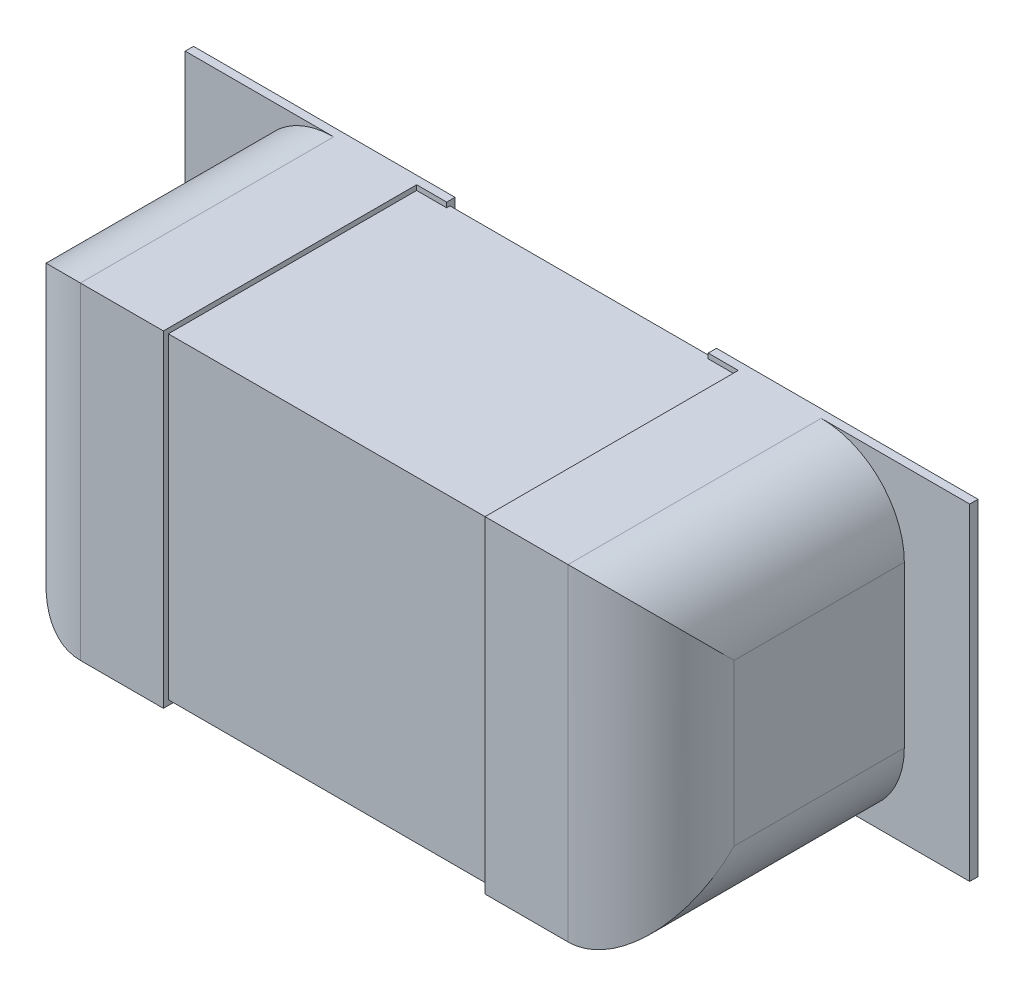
ISO-10303-21;
HEADER;
FILE_DESCRIPTION(('STEP AP214'),'2;1');
FILE_NAME('part.step','',(''),(''),'','','');
FILE_SCHEMA(('AUTOMOTIVE_DESIGN { 1 0 10303 214 1 1 1 1 }'));
ENDSEC;
DATA;
#1=APPLICATION_CONTEXT('core data for automotive mechanical design processes');
#2=APPLICATION_PROTOCOL_DEFINITION('international standard','automotive_design',2000,#1);
#3=PRODUCT_CONTEXT('',#1,'mechanical');
#4=PRODUCT('Part','Part','',(#3));
#5=PRODUCT_RELATED_PRODUCT_CATEGORY('part','',(#4));
#6=PRODUCT_DEFINITION_FORMATION('','',#4);
#7=PRODUCT_DEFINITION_CONTEXT('part definition',#1,'design');
#8=PRODUCT_DEFINITION('design','',#6,#7);
#9=PRODUCT_DEFINITION_SHAPE('','',#8);
#10=(LENGTH_UNIT() NAMED_UNIT(*) SI_UNIT(.MILLI.,.METRE.));
#11=(NAMED_UNIT(*) PLANE_ANGLE_UNIT() SI_UNIT($,.RADIAN.));
#12=(NAMED_UNIT(*) SI_UNIT($,.STERADIAN.) SOLID_ANGLE_UNIT());
#13=UNCERTAINTY_MEASURE_WITH_UNIT(LENGTH_MEASURE(1.E-05),#10,'distance_accuracy_value','');
#14=(GEOMETRIC_REPRESENTATION_CONTEXT(3) GLOBAL_UNCERTAINTY_ASSIGNED_CONTEXT((#13)) GLOBAL_UNIT_ASSIGNED_CONTEXT((#10,
#11,#12)) REPRESENTATION_CONTEXT('',''));
#15=CARTESIAN_POINT('',(0.,0.,0.));
#16=DIRECTION('',(0.,0.,1.));
#17=DIRECTION('',(1.,0.,0.));
#18=AXIS2_PLACEMENT_3D('',#15,#16,#17);
#19=CARTESIAN_POINT('',(0.500000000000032,-0.249999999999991,0.0762));
#20=DIRECTION('',(1.,0.,0.));
#21=DIRECTION('',(0.,0.,-1.));
#22=AXIS2_PLACEMENT_3D('',#19,#20,#21);
#23=PLANE('',#22);
#24=DIRECTION('',(0.,0.,-1.));
#25=VECTOR('',#24,1.);
#26=CARTESIAN_POINT('',(0.500000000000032,-0.122999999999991,0.478378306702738));
#27=LINE('',#26,#25);
#28=CARTESIAN_POINT('',(0.500000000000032,-0.122999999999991,0.0889));
#29=VERTEX_POINT('',#28);
#30=CARTESIAN_POINT('',(0.500000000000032,-0.122999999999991,0.34925));
#31=VERTEX_POINT('',#30);
#32=EDGE_CURVE('E336',#29,#31,#27,.F.);
#33=ORIENTED_EDGE('',*,*,#32,.F.);
#34=DIRECTION('',(0.,1.,0.));
#35=VECTOR('',#34,1.);
#36=CARTESIAN_POINT('',(0.500000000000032,0.,0.0889));
#37=LINE('',#36,#35);
#38=CARTESIAN_POINT('',(0.500000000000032,0.122999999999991,0.0889));
#39=VERTEX_POINT('',#38);
#40=EDGE_CURVE('E202',#39,#29,#37,.F.);
#41=ORIENTED_EDGE('',*,*,#40,.F.);
#42=DIRECTION('',(0.,0.,-1.));
#43=VECTOR('',#42,1.);
#44=CARTESIAN_POINT('',(0.500000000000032,0.122999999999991,0.478378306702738));
#45=LINE('',#44,#43);
#46=CARTESIAN_POINT('',(0.500000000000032,0.122999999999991,0.34925));
#47=VERTEX_POINT('',#46);
#48=EDGE_CURVE('E197',#47,#39,#45,.T.);
#49=ORIENTED_EDGE('',*,*,#48,.F.);
#50=DIRECTION('',(0.,1.,0.));
#51=VECTOR('',#50,1.);
#52=CARTESIAN_POINT('',(0.500000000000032,-0.252051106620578,0.34925));
#53=LINE('',#52,#51);
#54=EDGE_CURVE('E200',#31,#47,#53,.T.);
#55=ORIENTED_EDGE('',*,*,#54,.F.);
#56=EDGE_LOOP('',(#33,#41,#49,#55));
#57=FACE_BOUND('',#56,.T.);
#58=ADVANCED_FACE('F16',(#57),#23,.T.);
#59=CARTESIAN_POINT('',(-0.500000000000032,0.249999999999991,0.0762));
#60=DIRECTION('',(-1.,0.,0.));
#61=DIRECTION('',(0.,0.,1.));
#62=AXIS2_PLACEMENT_3D('',#59,#60,#61);
#63=PLANE('',#62);
#64=DIRECTION('',(0.,0.,-1.));
#65=VECTOR('',#64,1.);
#66=CARTESIAN_POINT('',(-0.500000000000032,0.122999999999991,0.478378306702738));
#67=LINE('',#66,#65);
#68=CARTESIAN_POINT('',(-0.500000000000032,0.122999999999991,0.0889));
#69=VERTEX_POINT('',#68);
#70=CARTESIAN_POINT('',(-0.500000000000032,0.122999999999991,0.34925));
#71=VERTEX_POINT('',#70);
#72=EDGE_CURVE('E321',#69,#71,#67,.F.);
#73=ORIENTED_EDGE('',*,*,#72,.F.);
#74=DIRECTION('',(0.,1.,0.));
#75=VECTOR('',#74,1.);
#76=CARTESIAN_POINT('',(-0.500000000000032,0.,0.0889));
#77=LINE('',#76,#75);
#78=CARTESIAN_POINT('',(-0.500000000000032,-0.122999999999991,0.0889));
#79=VERTEX_POINT('',#78);
#80=EDGE_CURVE('E325',#79,#69,#77,.T.);
#81=ORIENTED_EDGE('',*,*,#80,.F.);
#82=DIRECTION('',(0.,0.,-1.));
#83=VECTOR('',#82,1.);
#84=CARTESIAN_POINT('',(-0.500000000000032,-0.122999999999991,0.478378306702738));
#85=LINE('',#84,#83);
#86=CARTESIAN_POINT('',(-0.500000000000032,-0.122999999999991,0.34925));
#87=VERTEX_POINT('',#86);
#88=EDGE_CURVE('E350',#87,#79,#85,.T.);
#89=ORIENTED_EDGE('',*,*,#88,.F.);
#90=DIRECTION('',(0.,-1.,0.));
#91=VECTOR('',#90,1.);
#92=CARTESIAN_POINT('',(-0.500000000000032,0.252091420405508,0.34925));
#93=LINE('',#92,#91);
#94=EDGE_CURVE('E330',#71,#87,#93,.T.);
#95=ORIENTED_EDGE('',*,*,#94,.F.);
#96=EDGE_LOOP('',(#73,#81,#89,#95));
#97=FACE_BOUND('',#96,.T.);
#98=ADVANCED_FACE('F614',(#97),#63,.T.);
#99=CARTESIAN_POINT('',(0.373000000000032,0.122999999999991,0.478378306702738));
#100=DIRECTION('',(0.,0.,-1.));
#101=DIRECTION('',(-1.,0.,0.));
#102=AXIS2_PLACEMENT_3D('',#99,#100,#101);
#103=CYLINDRICAL_SURFACE('',#102,0.127);
#104=ORIENTED_EDGE('',*,*,#48,.T.);
#105=CARTESIAN_POINT('',(0.373000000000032,0.122999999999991,0.0889));
#106=DIRECTION('',(0.,0.,-1.));
#107=DIRECTION('',(-1.,0.,0.));
#108=AXIS2_PLACEMENT_3D('',#105,#106,#107);
#109=CIRCLE('',#108,0.127);
#110=CARTESIAN_POINT('',(0.372864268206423,0.249999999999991,0.0889000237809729));
#111=VERTEX_POINT('',#110);
#112=EDGE_CURVE('E219',#111,#39,#109,.T.);
#113=ORIENTED_EDGE('',*,*,#112,.F.);
#114=DIRECTION('',(-0.00035041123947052,0.,-0.99999993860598));
#115=VECTOR('',#114,1.);
#116=CARTESIAN_POINT('',(0.373000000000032,0.249999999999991,0.47625));
#117=LINE('',#116,#115);
#118=CARTESIAN_POINT('',(0.373000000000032,0.249999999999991,0.47625));
#119=VERTEX_POINT('',#118);
#120=EDGE_CURVE('E217',#119,#111,#117,.T.);
#121=ORIENTED_EDGE('',*,*,#120,.F.);
#122=CARTESIAN_POINT('',(0.373000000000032,0.122999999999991,0.34925));
#123=DIRECTION('',(0.,0.707106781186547,-0.707106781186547));
#124=DIRECTION('',(0.,0.707106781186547,0.707106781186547));
#125=AXIS2_PLACEMENT_3D('',#122,#123,#124);
#126=ELLIPSE('',#125,0.179605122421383,0.127);
#127=EDGE_CURVE('E19',#47,#119,#126,.F.);
#128=ORIENTED_EDGE('',*,*,#127,.F.);
#129=EDGE_LOOP('',(#104,#113,#121,#128));
#130=FACE_BOUND('',#129,.T.);
#131=ADVANCED_FACE('F216',(#130),#103,.T.);
#132=CARTESIAN_POINT('',(0.373000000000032,-0.252051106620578,0.34925));
#133=DIRECTION('',(0.,1.,0.));
#134=DIRECTION('',(0.,0.,1.));
#135=AXIS2_PLACEMENT_3D('',#132,#133,#134);
#136=CYLINDRICAL_SURFACE('',#135,0.127);
#137=CARTESIAN_POINT('',(0.373000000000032,-0.122999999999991,0.34925));
#138=DIRECTION('',(0.,-0.707106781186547,-0.707106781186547));
#139=DIRECTION('',(0.,0.707106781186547,-0.707106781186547));
#140=AXIS2_PLACEMENT_3D('',#137,#138,#139);
#141=ELLIPSE('',#140,0.179605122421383,0.127);
#142=CARTESIAN_POINT('',(0.373000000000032,-0.249999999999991,0.47625));
#143=VERTEX_POINT('',#142);
#144=EDGE_CURVE('E213',#31,#143,#141,.T.);
#145=ORIENTED_EDGE('',*,*,#144,.F.);
#146=ORIENTED_EDGE('',*,*,#54,.T.);
#147=ORIENTED_EDGE('',*,*,#127,.T.);
#148=DIRECTION('',(0.,1.,0.));
#149=VECTOR('',#148,1.);
#150=CARTESIAN_POINT('',(0.373000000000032,0.,0.47625));
#151=LINE('',#150,#149);
#152=EDGE_CURVE('E229',#143,#119,#151,.T.);
#153=ORIENTED_EDGE('',*,*,#152,.F.);
#154=EDGE_LOOP('',(#145,#146,#147,#153));
#155=FACE_BOUND('',#154,.T.);
#156=ADVANCED_FACE('F210',(#155),#136,.T.);
#157=CARTESIAN_POINT('',(0.5999988,-0.2500122,0.0762));
#158=DIRECTION('',(1.,0.,0.));
#159=DIRECTION('',(0.,0.,-1.));
#160=AXIS2_PLACEMENT_3D('',#157,#158,#159);
#161=PLANE('',#160);
#162=DIRECTION('',(0.,0.,-1.));
#163=VECTOR('',#162,1.);
#164=CARTESIAN_POINT('',(0.5999988,-0.249999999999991,0.0762));
#165=LINE('',#164,#163);
#166=CARTESIAN_POINT('',(0.5999988,-0.249999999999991,0.0762));
#167=VERTEX_POINT('',#166);
#168=CARTESIAN_POINT('',(0.5999988,-0.249999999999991,0.0889));
#169=VERTEX_POINT('',#168);
#170=EDGE_CURVE('E235',#167,#169,#165,.F.);
#171=ORIENTED_EDGE('',*,*,#170,.F.);
#172=DIRECTION('',(0.,1.,0.));
#173=VECTOR('',#172,1.);
#174=CARTESIAN_POINT('',(0.5999988,0.,0.0762));
#175=LINE('',#174,#173);
#176=CARTESIAN_POINT('',(0.5999988,0.249999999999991,0.0762));
#177=VERTEX_POINT('',#176);
#178=EDGE_CURVE('E334',#167,#177,#175,.T.);
#179=ORIENTED_EDGE('',*,*,#178,.T.);
#180=DIRECTION('',(0.,0.,1.));
#181=VECTOR('',#180,1.);
#182=CARTESIAN_POINT('',(0.5999988,0.249999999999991,0.0762));
#183=LINE('',#182,#181);
#184=CARTESIAN_POINT('',(0.5999988,0.249999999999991,0.0889));
#185=VERTEX_POINT('',#184);
#186=EDGE_CURVE('E313',#185,#177,#183,.F.);
#187=ORIENTED_EDGE('',*,*,#186,.F.);
#188=DIRECTION('',(0.,1.,0.));
#189=VECTOR('',#188,1.);
#190=CARTESIAN_POINT('',(0.5999988,0.,0.0889));
#191=LINE('',#190,#189);
#192=EDGE_CURVE('E214',#169,#185,#191,.T.);
#193=ORIENTED_EDGE('',*,*,#192,.F.);
#194=EDGE_LOOP('',(#171,#179,#187,#193));
#195=FACE_BOUND('',#194,.T.);
#196=ADVANCED_FACE('F346',(#195),#161,.T.);
#197=CARTESIAN_POINT('',(0.,0.,0.0889));
#198=DIRECTION('',(0.,0.,1.));
#199=DIRECTION('',(1.,0.,0.));
#200=AXIS2_PLACEMENT_3D('',#197,#198,#199);
#201=PLANE('',#200);
#202=ORIENTED_EDGE('',*,*,#112,.T.);
#203=ORIENTED_EDGE('',*,*,#40,.T.);
#204=CARTESIAN_POINT('',(0.373000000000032,-0.122999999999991,0.0889));
#205=DIRECTION('',(0.,0.,-1.));
#206=DIRECTION('',(-1.,0.,0.));
#207=AXIS2_PLACEMENT_3D('',#204,#205,#206);
#208=CIRCLE('',#207,0.127);
#209=CARTESIAN_POINT('',(0.372864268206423,-0.249999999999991,0.088900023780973));
#210=VERTEX_POINT('',#209);
#211=EDGE_CURVE('E331',#210,#29,#208,.F.);
#212=ORIENTED_EDGE('',*,*,#211,.F.);
#213=DIRECTION('',(1.,0.,0.));
#214=VECTOR('',#213,1.);
#215=CARTESIAN_POINT('',(-0.500000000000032,-0.249999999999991,0.0889));
#216=LINE('',#215,#214);
#217=EDGE_CURVE('E311',#169,#210,#216,.F.);
#218=ORIENTED_EDGE('',*,*,#217,.F.);
#219=ORIENTED_EDGE('',*,*,#192,.T.);
#220=DIRECTION('',(1.,0.,0.));
#221=VECTOR('',#220,1.);
#222=CARTESIAN_POINT('',(0.500000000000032,0.249999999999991,0.0889));
#223=LINE('',#222,#221);
#224=EDGE_CURVE('E224',#111,#185,#223,.T.);
#225=ORIENTED_EDGE('',*,*,#224,.F.);
#226=EDGE_LOOP('',(#202,#203,#212,#218,#219,#225));
#227=FACE_BOUND('',#226,.T.);
#228=ADVANCED_FACE('F340',(#227),#201,.T.);
#229=CARTESIAN_POINT('',(0.373000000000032,-0.122999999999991,0.478378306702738));
#230=DIRECTION('',(0.,0.,-1.));
#231=DIRECTION('',(-1.,0.,0.));
#232=AXIS2_PLACEMENT_3D('',#229,#230,#231);
#233=CYLINDRICAL_SURFACE('',#232,0.127);
#234=DIRECTION('',(0.00035041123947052,0.,0.99999993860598));
#235=VECTOR('',#234,1.);
#236=CARTESIAN_POINT('',(0.37286426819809,-0.249999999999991,0.0889));
#237=LINE('',#236,#235);
#238=EDGE_CURVE('E431',#210,#143,#237,.T.);
#239=ORIENTED_EDGE('',*,*,#238,.F.);
#240=ORIENTED_EDGE('',*,*,#211,.T.);
#241=ORIENTED_EDGE('',*,*,#32,.T.);
#242=ORIENTED_EDGE('',*,*,#144,.T.);
#243=EDGE_LOOP('',(#239,#240,#241,#242));
#244=FACE_BOUND('',#243,.T.);
#245=ADVANCED_FACE('F437',(#244),#233,.T.);
#246=CARTESIAN_POINT('',(0.,0.,0.0762));
#247=DIRECTION('',(0.,0.,1.));
#248=DIRECTION('',(1.,0.,0.));
#249=AXIS2_PLACEMENT_3D('',#246,#247,#248);
#250=PLANE('',#249);
#251=DIRECTION('',(1.,0.,0.));
#252=VECTOR('',#251,1.);
#253=CARTESIAN_POINT('',(-0.500000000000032,-0.249999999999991,0.0762));
#254=LINE('',#253,#252);
#255=CARTESIAN_POINT('',(0.1999996,-0.249999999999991,0.0762));
#256=VERTEX_POINT('',#255);
#257=EDGE_CURVE('E307',#256,#167,#254,.T.);
#258=ORIENTED_EDGE('',*,*,#257,.F.);
#259=DIRECTION('',(0.,1.,0.));
#260=VECTOR('',#259,1.);
#261=CARTESIAN_POINT('',(0.1999996,0.2500122,0.0762));
#262=LINE('',#261,#260);
#263=CARTESIAN_POINT('',(0.1999996,0.249999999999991,0.0762));
#264=VERTEX_POINT('',#263);
#265=EDGE_CURVE('E300',#264,#256,#262,.F.);
#266=ORIENTED_EDGE('',*,*,#265,.F.);
#267=DIRECTION('',(1.,0.,0.));
#268=VECTOR('',#267,1.);
#269=CARTESIAN_POINT('',(0.500000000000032,0.249999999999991,0.0762));
#270=LINE('',#269,#268);
#271=EDGE_CURVE('E243',#177,#264,#270,.F.);
#272=ORIENTED_EDGE('',*,*,#271,.F.);
#273=ORIENTED_EDGE('',*,*,#178,.F.);
#274=EDGE_LOOP('',(#258,#266,#272,#273));
#275=FACE_BOUND('',#274,.T.);
#276=ADVANCED_FACE('F353',(#275),#250,.F.);
#277=CARTESIAN_POINT('',(-0.373000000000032,-0.122999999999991,0.478378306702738));
#278=DIRECTION('',(0.,0.,-1.));
#279=DIRECTION('',(-1.,0.,0.));
#280=AXIS2_PLACEMENT_3D('',#277,#278,#279);
#281=CYLINDRICAL_SURFACE('',#280,0.127);
#282=ORIENTED_EDGE('',*,*,#88,.T.);
#283=CARTESIAN_POINT('',(-0.373000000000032,-0.122999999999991,0.0889));
#284=DIRECTION('',(0.,0.,-1.));
#285=DIRECTION('',(-1.,0.,0.));
#286=AXIS2_PLACEMENT_3D('',#283,#284,#285);
#287=CIRCLE('',#286,0.127);
#288=CARTESIAN_POINT('',(-0.372864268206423,-0.249999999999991,0.0889000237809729));
#289=VERTEX_POINT('',#288);
#290=EDGE_CURVE('E322',#289,#79,#287,.T.);
#291=ORIENTED_EDGE('',*,*,#290,.F.);
#292=DIRECTION('',(0.00035041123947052,0.,-0.99999993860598));
#293=VECTOR('',#292,1.);
#294=CARTESIAN_POINT('',(-0.373000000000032,-0.249999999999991,0.47625));
#295=LINE('',#294,#293);
#296=CARTESIAN_POINT('',(-0.373000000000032,-0.249999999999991,0.47625));
#297=VERTEX_POINT('',#296);
#298=EDGE_CURVE('E296',#297,#289,#295,.T.);
#299=ORIENTED_EDGE('',*,*,#298,.F.);
#300=CARTESIAN_POINT('',(-0.373000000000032,-0.122999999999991,0.34925));
#301=DIRECTION('',(0.,-0.707106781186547,-0.707106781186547));
#302=DIRECTION('',(0.,-0.707106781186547,0.707106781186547));
#303=AXIS2_PLACEMENT_3D('',#300,#301,#302);
#304=ELLIPSE('',#303,0.179605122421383,0.127);
#305=EDGE_CURVE('E328',#87,#297,#304,.F.);
#306=ORIENTED_EDGE('',*,*,#305,.F.);
#307=EDGE_LOOP('',(#282,#291,#299,#306));
#308=FACE_BOUND('',#307,.T.);
#309=ADVANCED_FACE('F610',(#308),#281,.T.);
#310=CARTESIAN_POINT('',(-0.373000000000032,0.252091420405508,0.34925));
#311=DIRECTION('',(0.,-1.,0.));
#312=DIRECTION('',(0.,0.,-1.));
#313=AXIS2_PLACEMENT_3D('',#310,#311,#312);
#314=CYLINDRICAL_SURFACE('',#313,0.127);
#315=ORIENTED_EDGE('',*,*,#305,.T.);
#316=DIRECTION('',(0.,1.,0.));
#317=VECTOR('',#316,1.);
#318=CARTESIAN_POINT('',(-0.373000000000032,0.,0.47625));
#319=LINE('',#318,#317);
#320=CARTESIAN_POINT('',(-0.373000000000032,0.249999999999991,0.47625));
#321=VERTEX_POINT('',#320);
#322=EDGE_CURVE('E285',#321,#297,#319,.F.);
#323=ORIENTED_EDGE('',*,*,#322,.F.);
#324=CARTESIAN_POINT('',(-0.373000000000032,0.122999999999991,0.34925));
#325=DIRECTION('',(0.,0.707106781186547,-0.707106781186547));
#326=DIRECTION('',(0.,-0.707106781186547,-0.707106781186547));
#327=AXIS2_PLACEMENT_3D('',#324,#325,#326);
#328=ELLIPSE('',#327,0.179605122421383,0.127);
#329=EDGE_CURVE('E319',#71,#321,#328,.T.);
#330=ORIENTED_EDGE('',*,*,#329,.F.);
#331=ORIENTED_EDGE('',*,*,#94,.T.);
#332=EDGE_LOOP('',(#315,#323,#330,#331));
#333=FACE_BOUND('',#332,.T.);
#334=ADVANCED_FACE('F605',(#333),#314,.T.);
#335=CARTESIAN_POINT('',(-0.5999988,0.2500122,0.0762));
#336=DIRECTION('',(-1.,0.,0.));
#337=DIRECTION('',(0.,0.,1.));
#338=AXIS2_PLACEMENT_3D('',#335,#336,#337);
#339=PLANE('',#338);
#340=DIRECTION('',(0.,0.,1.));
#341=VECTOR('',#340,1.);
#342=CARTESIAN_POINT('',(-0.5999988,0.249999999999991,0.0762));
#343=LINE('',#342,#341);
#344=CARTESIAN_POINT('',(-0.5999988,0.249999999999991,0.0762));
#345=VERTEX_POINT('',#344);
#346=CARTESIAN_POINT('',(-0.5999988,0.249999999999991,0.0889));
#347=VERTEX_POINT('',#346);
#348=EDGE_CURVE('E282',#345,#347,#343,.T.);
#349=ORIENTED_EDGE('',*,*,#348,.F.);
#350=DIRECTION('',(0.,1.,0.));
#351=VECTOR('',#350,1.);
#352=CARTESIAN_POINT('',(-0.5999988,0.,0.0762));
#353=LINE('',#352,#351);
#354=CARTESIAN_POINT('',(-0.5999988,-0.249999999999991,0.0762));
#355=VERTEX_POINT('',#354);
#356=EDGE_CURVE('E225',#345,#355,#353,.F.);
#357=ORIENTED_EDGE('',*,*,#356,.T.);
#358=DIRECTION('',(0.,0.,-1.));
#359=VECTOR('',#358,1.);
#360=CARTESIAN_POINT('',(-0.5999988,-0.249999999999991,0.0762));
#361=LINE('',#360,#359);
#362=CARTESIAN_POINT('',(-0.5999988,-0.249999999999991,0.0889));
#363=VERTEX_POINT('',#362);
#364=EDGE_CURVE('E291',#363,#355,#361,.T.);
#365=ORIENTED_EDGE('',*,*,#364,.F.);
#366=DIRECTION('',(0.,1.,0.));
#367=VECTOR('',#366,1.);
#368=CARTESIAN_POINT('',(-0.5999988,0.,0.0889));
#369=LINE('',#368,#367);
#370=EDGE_CURVE('E326',#347,#363,#369,.F.);
#371=ORIENTED_EDGE('',*,*,#370,.F.);
#372=EDGE_LOOP('',(#349,#357,#365,#371));
#373=FACE_BOUND('',#372,.T.);
#374=ADVANCED_FACE('F595',(#373),#339,.T.);
#375=CARTESIAN_POINT('',(0.,0.,0.0889));
#376=DIRECTION('',(0.,0.,1.));
#377=DIRECTION('',(1.,0.,0.));
#378=AXIS2_PLACEMENT_3D('',#375,#376,#377);
#379=PLANE('',#378);
#380=ORIENTED_EDGE('',*,*,#290,.T.);
#381=ORIENTED_EDGE('',*,*,#80,.T.);
#382=CARTESIAN_POINT('',(-0.373000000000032,0.122999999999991,0.0889));
#383=DIRECTION('',(0.,0.,-1.));
#384=DIRECTION('',(-1.,0.,0.));
#385=AXIS2_PLACEMENT_3D('',#382,#383,#384);
#386=CIRCLE('',#385,0.127);
#387=CARTESIAN_POINT('',(-0.372864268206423,0.249999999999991,0.088900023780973));
#388=VERTEX_POINT('',#387);
#389=EDGE_CURVE('E316',#388,#69,#386,.F.);
#390=ORIENTED_EDGE('',*,*,#389,.F.);
#391=DIRECTION('',(1.,0.,0.));
#392=VECTOR('',#391,1.);
#393=CARTESIAN_POINT('',(0.500000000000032,0.249999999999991,0.0889));
#394=LINE('',#393,#392);
#395=EDGE_CURVE('E284',#347,#388,#394,.T.);
#396=ORIENTED_EDGE('',*,*,#395,.F.);
#397=ORIENTED_EDGE('',*,*,#370,.T.);
#398=DIRECTION('',(1.,0.,0.));
#399=VECTOR('',#398,1.);
#400=CARTESIAN_POINT('',(-0.500000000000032,-0.249999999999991,0.0889));
#401=LINE('',#400,#399);
#402=EDGE_CURVE('E293',#289,#363,#401,.F.);
#403=ORIENTED_EDGE('',*,*,#402,.F.);
#404=EDGE_LOOP('',(#380,#381,#390,#396,#397,#403));
#405=FACE_BOUND('',#404,.T.);
#406=ADVANCED_FACE('F600',(#405),#379,.T.);
#407=CARTESIAN_POINT('',(-0.373000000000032,0.122999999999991,0.478378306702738));
#408=DIRECTION('',(0.,0.,-1.));
#409=DIRECTION('',(-1.,0.,0.));
#410=AXIS2_PLACEMENT_3D('',#407,#408,#409);
#411=CYLINDRICAL_SURFACE('',#410,0.127);
#412=DIRECTION('',(-0.00035041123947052,0.,0.99999993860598));
#413=VECTOR('',#412,1.);
#414=CARTESIAN_POINT('',(-0.37286426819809,0.249999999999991,0.0889));
#415=LINE('',#414,#413);
#416=EDGE_CURVE('E408',#388,#321,#415,.T.);
#417=ORIENTED_EDGE('',*,*,#416,.F.);
#418=ORIENTED_EDGE('',*,*,#389,.T.);
#419=ORIENTED_EDGE('',*,*,#72,.T.);
#420=ORIENTED_EDGE('',*,*,#329,.T.);
#421=EDGE_LOOP('',(#417,#418,#419,#420));
#422=FACE_BOUND('',#421,.T.);
#423=ADVANCED_FACE('F615',(#422),#411,.T.);
#424=CARTESIAN_POINT('',(0.,0.,0.0762));
#425=DIRECTION('',(0.,0.,1.));
#426=DIRECTION('',(1.,0.,0.));
#427=AXIS2_PLACEMENT_3D('',#424,#425,#426);
#428=PLANE('',#427);
#429=DIRECTION('',(1.,0.,0.));
#430=VECTOR('',#429,1.);
#431=CARTESIAN_POINT('',(0.500000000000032,0.249999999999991,0.0762));
#432=LINE('',#431,#430);
#433=CARTESIAN_POINT('',(-0.1999996,0.249999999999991,0.0762));
#434=VERTEX_POINT('',#433);
#435=EDGE_CURVE('E275',#434,#345,#432,.F.);
#436=ORIENTED_EDGE('',*,*,#435,.F.);
#437=DIRECTION('',(0.,1.,0.));
#438=VECTOR('',#437,1.);
#439=CARTESIAN_POINT('',(-0.1999996,-0.2500122,0.0762));
#440=LINE('',#439,#438);
#441=CARTESIAN_POINT('',(-0.1999996,-0.249999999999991,0.0762));
#442=VERTEX_POINT('',#441);
#443=EDGE_CURVE('E401',#442,#434,#440,.T.);
#444=ORIENTED_EDGE('',*,*,#443,.F.);
#445=DIRECTION('',(1.,0.,0.));
#446=VECTOR('',#445,1.);
#447=CARTESIAN_POINT('',(-0.500000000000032,-0.249999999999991,0.0762));
#448=LINE('',#447,#446);
#449=EDGE_CURVE('E289',#355,#442,#448,.T.);
#450=ORIENTED_EDGE('',*,*,#449,.F.);
#451=ORIENTED_EDGE('',*,*,#356,.F.);
#452=EDGE_LOOP('',(#436,#444,#450,#451));
#453=FACE_BOUND('',#452,.T.);
#454=ADVANCED_FACE('F591',(#453),#428,.F.);
#455=CARTESIAN_POINT('',(0.,0.,0.0889));
#456=DIRECTION('',(0.,0.,1.));
#457=DIRECTION('',(1.,0.,0.));
#458=AXIS2_PLACEMENT_3D('',#455,#456,#457);
#459=PLANE('',#458);
#460=DIRECTION('',(1.,0.,0.));
#461=VECTOR('',#460,1.);
#462=CARTESIAN_POINT('',(-0.246000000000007,0.242379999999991,0.0889));
#463=LINE('',#462,#461);
#464=CARTESIAN_POINT('',(0.1999996,0.242379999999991,0.0889));
#465=VERTEX_POINT('',#464);
#466=CARTESIAN_POINT('',(0.246000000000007,0.242379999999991,0.0889));
#467=VERTEX_POINT('',#466);
#468=EDGE_CURVE('E270',#465,#467,#463,.T.);
#469=ORIENTED_EDGE('',*,*,#468,.T.);
#470=DIRECTION('',(0.,1.,0.));
#471=VECTOR('',#470,1.);
#472=CARTESIAN_POINT('',(0.246000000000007,-0.249999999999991,0.0889));
#473=LINE('',#472,#471);
#474=CARTESIAN_POINT('',(0.246000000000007,0.250002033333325,0.0889));
#475=VERTEX_POINT('',#474);
#476=EDGE_CURVE('E255',#467,#475,#473,.T.);
#477=ORIENTED_EDGE('',*,*,#476,.T.);
#478=DIRECTION('',(1.,0.,0.));
#479=VECTOR('',#478,1.);
#480=CARTESIAN_POINT('',(0.500000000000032,0.249999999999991,0.0889));
#481=LINE('',#480,#479);
#482=CARTESIAN_POINT('',(0.1999996,0.249999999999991,0.0889));
#483=VERTEX_POINT('',#482);
#484=EDGE_CURVE('E241',#483,#475,#481,.T.);
#485=ORIENTED_EDGE('',*,*,#484,.F.);
#486=DIRECTION('',(0.,1.,0.));
#487=VECTOR('',#486,1.);
#488=CARTESIAN_POINT('',(0.1999996,0.2500122,0.0889));
#489=LINE('',#488,#487);
#490=EDGE_CURVE('E304',#465,#483,#489,.T.);
#491=ORIENTED_EDGE('',*,*,#490,.F.);
#492=EDGE_LOOP('',(#469,#477,#485,#491));
#493=FACE_BOUND('',#492,.T.);
#494=ADVANCED_FACE('F365',(#493),#459,.T.);
#495=CARTESIAN_POINT('',(0.500000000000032,0.249999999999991,0.0762));
#496=DIRECTION('',(0.,1.,0.));
#497=DIRECTION('',(0.,0.,1.));
#498=AXIS2_PLACEMENT_3D('',#495,#496,#497);
#499=PLANE('',#498);
#500=ORIENTED_EDGE('',*,*,#484,.T.);
#501=DIRECTION('',(0.,0.,-1.));
#502=VECTOR('',#501,1.);
#503=CARTESIAN_POINT('',(0.246000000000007,0.25000406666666,0.08382));
#504=LINE('',#503,#502);
#505=CARTESIAN_POINT('',(0.246000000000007,0.249999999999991,0.47625));
#506=VERTEX_POINT('',#505);
#507=EDGE_CURVE('E240',#475,#506,#504,.F.);
#508=ORIENTED_EDGE('',*,*,#507,.T.);
#509=DIRECTION('',(1.,0.,0.));
#510=VECTOR('',#509,1.);
#511=CARTESIAN_POINT('',(0.,0.249999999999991,0.47625));
#512=LINE('',#511,#510);
#513=EDGE_CURVE('E232',#119,#506,#512,.F.);
#514=ORIENTED_EDGE('',*,*,#513,.F.);
#515=ORIENTED_EDGE('',*,*,#120,.T.);
#516=ORIENTED_EDGE('',*,*,#224,.T.);
#517=ORIENTED_EDGE('',*,*,#186,.T.);
#518=ORIENTED_EDGE('',*,*,#271,.T.);
#519=DIRECTION('',(0.,0.,-1.));
#520=VECTOR('',#519,1.);
#521=CARTESIAN_POINT('',(0.1999996,0.249999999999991,0.0762));
#522=LINE('',#521,#520);
#523=EDGE_CURVE('E301',#483,#264,#522,.T.);
#524=ORIENTED_EDGE('',*,*,#523,.F.);
#525=EDGE_LOOP('',(#500,#508,#514,#515,#516,#517,#518,#524));
#526=FACE_BOUND('',#525,.T.);
#527=ADVANCED_FACE('F238',(#526),#499,.T.);
#528=CARTESIAN_POINT('',(0.,0.,0.47625));
#529=DIRECTION('',(0.,0.,1.));
#530=DIRECTION('',(1.,0.,0.));
#531=AXIS2_PLACEMENT_3D('',#528,#529,#530);
#532=PLANE('',#531);
#533=DIRECTION('',(1.,0.,0.));
#534=VECTOR('',#533,1.);
#535=CARTESIAN_POINT('',(-0.500000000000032,-0.249999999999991,0.47625));
#536=LINE('',#535,#534);
#537=CARTESIAN_POINT('',(0.246000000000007,-0.249999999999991,0.47625));
#538=VERTEX_POINT('',#537);
#539=EDGE_CURVE('E234',#143,#538,#536,.F.);
#540=ORIENTED_EDGE('',*,*,#539,.F.);
#541=ORIENTED_EDGE('',*,*,#152,.T.);
#542=ORIENTED_EDGE('',*,*,#513,.T.);
#543=DIRECTION('',(0.,1.,0.));
#544=VECTOR('',#543,1.);
#545=CARTESIAN_POINT('',(0.246000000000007,-0.249999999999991,0.47625));
#546=LINE('',#545,#544);
#547=EDGE_CURVE('E249',#506,#538,#546,.F.);
#548=ORIENTED_EDGE('',*,*,#547,.T.);
#549=EDGE_LOOP('',(#540,#541,#542,#548));
#550=FACE_BOUND('',#549,.T.);
#551=ADVANCED_FACE('F230',(#550),#532,.T.);
#552=CARTESIAN_POINT('',(-0.500000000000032,-0.249999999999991,0.0762));
#553=DIRECTION('',(0.,-1.,0.));
#554=DIRECTION('',(0.,0.,-1.));
#555=AXIS2_PLACEMENT_3D('',#552,#553,#554);
#556=PLANE('',#555);
#557=DIRECTION('',(0.,0.,1.));
#558=VECTOR('',#557,1.);
#559=CARTESIAN_POINT('',(0.1999996,-0.249999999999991,0.0762));
#560=LINE('',#559,#558);
#561=CARTESIAN_POINT('',(0.1999996,-0.249999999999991,0.0889));
#562=VERTEX_POINT('',#561);
#563=EDGE_CURVE('E297',#256,#562,#560,.T.);
#564=ORIENTED_EDGE('',*,*,#563,.F.);
#565=ORIENTED_EDGE('',*,*,#257,.T.);
#566=ORIENTED_EDGE('',*,*,#170,.T.);
#567=ORIENTED_EDGE('',*,*,#217,.T.);
#568=ORIENTED_EDGE('',*,*,#238,.T.);
#569=ORIENTED_EDGE('',*,*,#539,.T.);
#570=DIRECTION('',(0.,0.,-1.));
#571=VECTOR('',#570,1.);
#572=CARTESIAN_POINT('',(0.246000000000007,-0.249999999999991,0.08382));
#573=LINE('',#572,#571);
#574=CARTESIAN_POINT('',(0.246000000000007,-0.249999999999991,0.0889));
#575=VERTEX_POINT('',#574);
#576=EDGE_CURVE('E251',#538,#575,#573,.T.);
#577=ORIENTED_EDGE('',*,*,#576,.T.);
#578=DIRECTION('',(1.,0.,0.));
#579=VECTOR('',#578,1.);
#580=CARTESIAN_POINT('',(0.,-0.249999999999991,0.0889));
#581=LINE('',#580,#579);
#582=EDGE_CURVE('E305',#562,#575,#581,.T.);
#583=ORIENTED_EDGE('',*,*,#582,.F.);
#584=EDGE_LOOP('',(#564,#565,#566,#567,#568,#569,#577,#583));
#585=FACE_BOUND('',#584,.T.);
#586=ADVANCED_FACE('F439',(#585),#556,.T.);
#587=CARTESIAN_POINT('',(0.,0.,0.0889));
#588=DIRECTION('',(0.,0.,1.));
#589=DIRECTION('',(1.,0.,0.));
#590=AXIS2_PLACEMENT_3D('',#587,#588,#589);
#591=PLANE('',#590);
#592=DIRECTION('',(0.,1.,0.));
#593=VECTOR('',#592,1.);
#594=CARTESIAN_POINT('',(0.1999996,0.2500122,0.0889));
#595=LINE('',#594,#593);
#596=CARTESIAN_POINT('',(0.1999996,-0.242379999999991,0.0889));
#597=VERTEX_POINT('',#596);
#598=EDGE_CURVE('E299',#562,#597,#595,.T.);
#599=ORIENTED_EDGE('',*,*,#598,.F.);
#600=ORIENTED_EDGE('',*,*,#582,.T.);
#601=DIRECTION('',(0.,1.,0.));
#602=VECTOR('',#601,1.);
#603=CARTESIAN_POINT('',(0.246000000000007,0.,0.0889));
#604=LINE('',#603,#602);
#605=CARTESIAN_POINT('',(0.246000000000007,-0.242379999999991,0.0889));
#606=VERTEX_POINT('',#605);
#607=EDGE_CURVE('E268',#575,#606,#604,.T.);
#608=ORIENTED_EDGE('',*,*,#607,.T.);
#609=DIRECTION('',(1.,0.,0.));
#610=VECTOR('',#609,1.);
#611=CARTESIAN_POINT('',(-0.246000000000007,-0.242379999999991,0.0889));
#612=LINE('',#611,#610);
#613=EDGE_CURVE('E385',#606,#597,#612,.F.);
#614=ORIENTED_EDGE('',*,*,#613,.T.);
#615=EDGE_LOOP('',(#599,#600,#608,#614));
#616=FACE_BOUND('',#615,.T.);
#617=ADVANCED_FACE('F451',(#616),#591,.T.);
#618=CARTESIAN_POINT('',(0.1999996,0.2500122,0.0762));
#619=DIRECTION('',(-1.,0.,0.));
#620=DIRECTION('',(0.,0.,1.));
#621=AXIS2_PLACEMENT_3D('',#618,#619,#620);
#622=PLANE('',#621);
#623=DIRECTION('',(0.,0.,1.));
#624=VECTOR('',#623,1.);
#625=CARTESIAN_POINT('',(0.1999996,-0.242379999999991,0.47625));
#626=LINE('',#625,#624);
#627=CARTESIAN_POINT('',(0.1999996,-0.242379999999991,0.08382));
#628=VERTEX_POINT('',#627);
#629=EDGE_CURVE('E388',#597,#628,#626,.F.);
#630=ORIENTED_EDGE('',*,*,#629,.T.);
#631=DIRECTION('',(0.,1.,0.));
#632=VECTOR('',#631,1.);
#633=CARTESIAN_POINT('',(0.1999996,-0.249999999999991,0.08382));
#634=LINE('',#633,#632);
#635=CARTESIAN_POINT('',(0.1999996,0.242379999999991,0.08382));
#636=VERTEX_POINT('',#635);
#637=EDGE_CURVE('E404',#628,#636,#634,.T.);
#638=ORIENTED_EDGE('',*,*,#637,.T.);
#639=DIRECTION('',(0.,0.,-1.));
#640=VECTOR('',#639,1.);
#641=CARTESIAN_POINT('',(0.1999996,0.242379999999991,0.0762));
#642=LINE('',#641,#640);
#643=EDGE_CURVE('E361',#636,#465,#642,.F.);
#644=ORIENTED_EDGE('',*,*,#643,.T.);
#645=ORIENTED_EDGE('',*,*,#490,.T.);
#646=ORIENTED_EDGE('',*,*,#523,.T.);
#647=ORIENTED_EDGE('',*,*,#265,.T.);
#648=ORIENTED_EDGE('',*,*,#563,.T.);
#649=ORIENTED_EDGE('',*,*,#598,.T.);
#650=EDGE_LOOP('',(#630,#638,#644,#645,#646,#647,#648,#649));
#651=FACE_BOUND('',#650,.T.);
#652=ADVANCED_FACE('F357',(#651),#622,.T.);
#653=CARTESIAN_POINT('',(-0.246000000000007,-0.249999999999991,0.08382));
#654=DIRECTION('',(0.,0.,1.));
#655=DIRECTION('',(1.,0.,0.));
#656=AXIS2_PLACEMENT_3D('',#653,#654,#655);
#657=PLANE('',#656);
#658=DIRECTION('',(0.,1.,0.));
#659=VECTOR('',#658,1.);
#660=CARTESIAN_POINT('',(-0.1999996,-0.2500122,0.08382));
#661=LINE('',#660,#659);
#662=CARTESIAN_POINT('',(-0.1999996,0.242379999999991,0.08382));
#663=VERTEX_POINT('',#662);
#664=CARTESIAN_POINT('',(-0.1999996,-0.242379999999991,0.08382));
#665=VERTEX_POINT('',#664);
#666=EDGE_CURVE('E403',#663,#665,#661,.F.);
#667=ORIENTED_EDGE('',*,*,#666,.F.);
#668=DIRECTION('',(1.,0.,0.));
#669=VECTOR('',#668,1.);
#670=CARTESIAN_POINT('',(-0.246000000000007,0.242379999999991,0.08382));
#671=LINE('',#670,#669);
#672=EDGE_CURVE('E396',#663,#636,#671,.T.);
#673=ORIENTED_EDGE('',*,*,#672,.T.);
#674=ORIENTED_EDGE('',*,*,#637,.F.);
#675=DIRECTION('',(1.,0.,0.));
#676=VECTOR('',#675,1.);
#677=CARTESIAN_POINT('',(-0.246000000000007,-0.242379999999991,0.08382));
#678=LINE('',#677,#676);
#679=EDGE_CURVE('E449',#628,#665,#678,.F.);
#680=ORIENTED_EDGE('',*,*,#679,.T.);
#681=EDGE_LOOP('',(#667,#673,#674,#680));
#682=FACE_BOUND('',#681,.T.);
#683=ADVANCED_FACE('F459',(#682),#657,.F.);
#684=CARTESIAN_POINT('',(-0.1999996,-0.2500122,0.0762));
#685=DIRECTION('',(1.,0.,0.));
#686=DIRECTION('',(0.,0.,-1.));
#687=AXIS2_PLACEMENT_3D('',#684,#685,#686);
#688=PLANE('',#687);
#689=DIRECTION('',(0.,0.,-1.));
#690=VECTOR('',#689,1.);
#691=CARTESIAN_POINT('',(-0.1999996,0.242379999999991,0.0762));
#692=LINE('',#691,#690);
#693=CARTESIAN_POINT('',(-0.1999996,0.242379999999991,0.0889));
#694=VERTEX_POINT('',#693);
#695=EDGE_CURVE('E393',#694,#663,#692,.T.);
#696=ORIENTED_EDGE('',*,*,#695,.T.);
#697=ORIENTED_EDGE('',*,*,#666,.T.);
#698=DIRECTION('',(0.,0.,1.));
#699=VECTOR('',#698,1.);
#700=CARTESIAN_POINT('',(-0.1999996,-0.242379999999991,0.47625));
#701=LINE('',#700,#699);
#702=CARTESIAN_POINT('',(-0.1999996,-0.242379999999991,0.0889));
#703=VERTEX_POINT('',#702);
#704=EDGE_CURVE('E550',#665,#703,#701,.T.);
#705=ORIENTED_EDGE('',*,*,#704,.T.);
#706=DIRECTION('',(0.,1.,0.));
#707=VECTOR('',#706,1.);
#708=CARTESIAN_POINT('',(-0.1999996,0.,0.0889));
#709=LINE('',#708,#707);
#710=CARTESIAN_POINT('',(-0.1999996,-0.249999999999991,0.0889));
#711=VERTEX_POINT('',#710);
#712=EDGE_CURVE('E416',#711,#703,#709,.T.);
#713=ORIENTED_EDGE('',*,*,#712,.F.);
#714=DIRECTION('',(0.,0.,-1.));
#715=VECTOR('',#714,1.);
#716=CARTESIAN_POINT('',(-0.1999996,-0.249999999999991,0.0762));
#717=LINE('',#716,#715);
#718=EDGE_CURVE('E286',#442,#711,#717,.F.);
#719=ORIENTED_EDGE('',*,*,#718,.F.);
#720=ORIENTED_EDGE('',*,*,#443,.T.);
#721=DIRECTION('',(0.,0.,1.));
#722=VECTOR('',#721,1.);
#723=CARTESIAN_POINT('',(-0.1999996,0.249999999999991,0.0762));
#724=LINE('',#723,#722);
#725=CARTESIAN_POINT('',(-0.1999996,0.249999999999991,0.0889));
#726=VERTEX_POINT('',#725);
#727=EDGE_CURVE('E278',#726,#434,#724,.F.);
#728=ORIENTED_EDGE('',*,*,#727,.F.);
#729=DIRECTION('',(0.,1.,0.));
#730=VECTOR('',#729,1.);
#731=CARTESIAN_POINT('',(-0.1999996,0.,0.0889));
#732=LINE('',#731,#730);
#733=EDGE_CURVE('E274',#694,#726,#732,.T.);
#734=ORIENTED_EDGE('',*,*,#733,.F.);
#735=EDGE_LOOP('',(#696,#697,#705,#713,#719,#720,#728,#734));
#736=FACE_BOUND('',#735,.T.);
#737=ADVANCED_FACE('F500',(#736),#688,.T.);
#738=CARTESIAN_POINT('',(0.,0.,0.0889));
#739=DIRECTION('',(0.,0.,1.));
#740=DIRECTION('',(1.,0.,0.));
#741=AXIS2_PLACEMENT_3D('',#738,#739,#740);
#742=PLANE('',#741);
#743=DIRECTION('',(1.,0.,0.));
#744=VECTOR('',#743,1.);
#745=CARTESIAN_POINT('',(-0.246000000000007,-0.242379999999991,0.0889));
#746=LINE('',#745,#744);
#747=CARTESIAN_POINT('',(-0.246000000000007,-0.242379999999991,0.0889));
#748=VERTEX_POINT('',#747);
#749=EDGE_CURVE('E376',#703,#748,#746,.F.);
#750=ORIENTED_EDGE('',*,*,#749,.T.);
#751=DIRECTION('',(0.,1.,0.));
#752=VECTOR('',#751,1.);
#753=CARTESIAN_POINT('',(-0.246000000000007,-0.249999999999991,0.0889));
#754=LINE('',#753,#752);
#755=CARTESIAN_POINT('',(-0.246000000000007,-0.250002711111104,0.0889));
#756=VERTEX_POINT('',#755);
#757=EDGE_CURVE('E542',#748,#756,#754,.F.);
#758=ORIENTED_EDGE('',*,*,#757,.T.);
#759=DIRECTION('',(1.,0.,0.));
#760=VECTOR('',#759,1.);
#761=CARTESIAN_POINT('',(-0.500000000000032,-0.249999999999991,0.0889));
#762=LINE('',#761,#760);
#763=EDGE_CURVE('E288',#711,#756,#762,.F.);
#764=ORIENTED_EDGE('',*,*,#763,.F.);
#765=ORIENTED_EDGE('',*,*,#712,.T.);
#766=EDGE_LOOP('',(#750,#758,#764,#765));
#767=FACE_BOUND('',#766,.T.);
#768=ADVANCED_FACE('F496',(#767),#742,.T.);
#769=CARTESIAN_POINT('',(-0.500000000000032,-0.249999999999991,0.0762));
#770=DIRECTION('',(0.,-1.,0.));
#771=DIRECTION('',(0.,0.,-1.));
#772=AXIS2_PLACEMENT_3D('',#769,#770,#771);
#773=PLANE('',#772);
#774=ORIENTED_EDGE('',*,*,#763,.T.);
#775=DIRECTION('',(0.,0.,1.));
#776=VECTOR('',#775,1.);
#777=CARTESIAN_POINT('',(-0.246000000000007,-0.25000406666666,0.0762));
#778=LINE('',#777,#776);
#779=CARTESIAN_POINT('',(-0.246000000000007,-0.250002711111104,0.47625));
#780=VERTEX_POINT('',#779);
#781=EDGE_CURVE('E534',#756,#780,#778,.T.);
#782=ORIENTED_EDGE('',*,*,#781,.T.);
#783=DIRECTION('',(1.,0.,0.));
#784=VECTOR('',#783,1.);
#785=CARTESIAN_POINT('',(0.,-0.249999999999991,0.47625));
#786=LINE('',#785,#784);
#787=EDGE_CURVE('E407',#297,#780,#786,.T.);
#788=ORIENTED_EDGE('',*,*,#787,.F.);
#789=ORIENTED_EDGE('',*,*,#298,.T.);
#790=ORIENTED_EDGE('',*,*,#402,.T.);
#791=ORIENTED_EDGE('',*,*,#364,.T.);
#792=ORIENTED_EDGE('',*,*,#449,.T.);
#793=ORIENTED_EDGE('',*,*,#718,.T.);
#794=EDGE_LOOP('',(#774,#782,#788,#789,#790,#791,#792,#793));
#795=FACE_BOUND('',#794,.T.);
#796=ADVANCED_FACE('F492',(#795),#773,.T.);
#797=CARTESIAN_POINT('',(0.,0.,0.47625));
#798=DIRECTION('',(0.,0.,1.));
#799=DIRECTION('',(1.,0.,0.));
#800=AXIS2_PLACEMENT_3D('',#797,#798,#799);
#801=PLANE('',#800);
#802=DIRECTION('',(1.,0.,0.));
#803=VECTOR('',#802,1.);
#804=CARTESIAN_POINT('',(0.500000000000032,0.249999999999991,0.47625));
#805=LINE('',#804,#803);
#806=CARTESIAN_POINT('',(-0.246000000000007,0.249999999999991,0.47625));
#807=VERTEX_POINT('',#806);
#808=EDGE_CURVE('E281',#321,#807,#805,.T.);
#809=ORIENTED_EDGE('',*,*,#808,.F.);
#810=ORIENTED_EDGE('',*,*,#322,.T.);
#811=ORIENTED_EDGE('',*,*,#787,.T.);
#812=DIRECTION('',(0.,1.,0.));
#813=VECTOR('',#812,1.);
#814=CARTESIAN_POINT('',(-0.246000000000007,-0.249999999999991,0.47625));
#815=LINE('',#814,#813);
#816=EDGE_CURVE('E531',#780,#807,#815,.T.);
#817=ORIENTED_EDGE('',*,*,#816,.T.);
#818=EDGE_LOOP('',(#809,#810,#811,#817));
#819=FACE_BOUND('',#818,.T.);
#820=ADVANCED_FACE('F488',(#819),#801,.T.);
#821=CARTESIAN_POINT('',(0.500000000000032,0.249999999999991,0.0762));
#822=DIRECTION('',(0.,1.,0.));
#823=DIRECTION('',(0.,0.,1.));
#824=AXIS2_PLACEMENT_3D('',#821,#822,#823);
#825=PLANE('',#824);
#826=ORIENTED_EDGE('',*,*,#727,.T.);
#827=ORIENTED_EDGE('',*,*,#435,.T.);
#828=ORIENTED_EDGE('',*,*,#348,.T.);
#829=ORIENTED_EDGE('',*,*,#395,.T.);
#830=ORIENTED_EDGE('',*,*,#416,.T.);
#831=ORIENTED_EDGE('',*,*,#808,.T.);
#832=DIRECTION('',(0.,0.,1.));
#833=VECTOR('',#832,1.);
#834=CARTESIAN_POINT('',(-0.246000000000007,0.249999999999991,0.0762));
#835=LINE('',#834,#833);
#836=CARTESIAN_POINT('',(-0.246000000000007,0.249999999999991,0.0889));
#837=VERTEX_POINT('',#836);
#838=EDGE_CURVE('E267',#807,#837,#835,.F.);
#839=ORIENTED_EDGE('',*,*,#838,.T.);
#840=DIRECTION('',(-1.,0.,0.));
#841=VECTOR('',#840,1.);
#842=CARTESIAN_POINT('',(0.,0.249999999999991,0.0889));
#843=LINE('',#842,#841);
#844=EDGE_CURVE('E271',#726,#837,#843,.T.);
#845=ORIENTED_EDGE('',*,*,#844,.F.);
#846=EDGE_LOOP('',(#826,#827,#828,#829,#830,#831,#839,#845));
#847=FACE_BOUND('',#846,.T.);
#848=ADVANCED_FACE('F484',(#847),#825,.T.);
#849=CARTESIAN_POINT('',(0.,0.,0.0889));
#850=DIRECTION('',(0.,0.,1.));
#851=DIRECTION('',(1.,0.,0.));
#852=AXIS2_PLACEMENT_3D('',#849,#850,#851);
#853=PLANE('',#852);
#854=ORIENTED_EDGE('',*,*,#733,.T.);
#855=ORIENTED_EDGE('',*,*,#844,.T.);
#856=DIRECTION('',(0.,1.,0.));
#857=VECTOR('',#856,1.);
#858=CARTESIAN_POINT('',(-0.246000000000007,0.,0.0889));
#859=LINE('',#858,#857);
#860=CARTESIAN_POINT('',(-0.246000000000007,0.242379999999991,0.0889));
#861=VERTEX_POINT('',#860);
#862=EDGE_CURVE('E263',#837,#861,#859,.F.);
#863=ORIENTED_EDGE('',*,*,#862,.T.);
#864=DIRECTION('',(1.,0.,0.));
#865=VECTOR('',#864,1.);
#866=CARTESIAN_POINT('',(-0.246000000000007,0.242379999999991,0.0889));
#867=LINE('',#866,#865);
#868=EDGE_CURVE('E273',#861,#694,#867,.T.);
#869=ORIENTED_EDGE('',*,*,#868,.T.);
#870=EDGE_LOOP('',(#854,#855,#863,#869));
#871=FACE_BOUND('',#870,.T.);
#872=ADVANCED_FACE('F480',(#871),#853,.T.);
#873=CARTESIAN_POINT('',(-0.246000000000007,0.242379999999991,0.0762));
#874=DIRECTION('',(0.,-1.,0.));
#875=DIRECTION('',(0.,0.,-1.));
#876=AXIS2_PLACEMENT_3D('',#873,#874,#875);
#877=PLANE('',#876);
#878=DIRECTION('',(-1.,0.,0.));
#879=VECTOR('',#878,1.);
#880=CARTESIAN_POINT('',(-0.246000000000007,0.242379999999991,0.46863));
#881=LINE('',#880,#879);
#882=CARTESIAN_POINT('',(-0.246000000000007,0.242379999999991,0.46863));
#883=VERTEX_POINT('',#882);
#884=CARTESIAN_POINT('',(0.246000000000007,0.242379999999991,0.46863));
#885=VERTEX_POINT('',#884);
#886=EDGE_CURVE('E556',#883,#885,#881,.F.);
#887=ORIENTED_EDGE('',*,*,#886,.T.);
#888=DIRECTION('',(0.,0.,-1.));
#889=VECTOR('',#888,1.);
#890=CARTESIAN_POINT('',(0.246000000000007,0.242379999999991,0.08382));
#891=LINE('',#890,#889);
#892=EDGE_CURVE('E260',#885,#467,#891,.T.);
#893=ORIENTED_EDGE('',*,*,#892,.T.);
#894=ORIENTED_EDGE('',*,*,#468,.F.);
#895=ORIENTED_EDGE('',*,*,#643,.F.);
#896=ORIENTED_EDGE('',*,*,#672,.F.);
#897=ORIENTED_EDGE('',*,*,#695,.F.);
#898=ORIENTED_EDGE('',*,*,#868,.F.);
#899=DIRECTION('',(0.,0.,1.));
#900=VECTOR('',#899,1.);
#901=CARTESIAN_POINT('',(-0.246000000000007,0.242379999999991,0.0762));
#902=LINE('',#901,#900);
#903=EDGE_CURVE('E266',#861,#883,#902,.T.);
#904=ORIENTED_EDGE('',*,*,#903,.T.);
#905=EDGE_LOOP('',(#887,#893,#894,#895,#896,#897,#898,#904));
#906=FACE_BOUND('',#905,.T.);
#907=ADVANCED_FACE('F477',(#906),#877,.F.);
#908=CARTESIAN_POINT('',(0.246000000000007,-0.249999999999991,0.08382));
#909=DIRECTION('',(1.,0.,0.));
#910=DIRECTION('',(0.,0.,-1.));
#911=AXIS2_PLACEMENT_3D('',#908,#909,#910);
#912=PLANE('',#911);
#913=ORIENTED_EDGE('',*,*,#547,.F.);
#914=ORIENTED_EDGE('',*,*,#507,.F.);
#915=ORIENTED_EDGE('',*,*,#476,.F.);
#916=ORIENTED_EDGE('',*,*,#892,.F.);
#917=DIRECTION('',(0.,1.,0.));
#918=VECTOR('',#917,1.);
#919=CARTESIAN_POINT('',(0.246000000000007,0.249999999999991,0.46863));
#920=LINE('',#919,#918);
#921=CARTESIAN_POINT('',(0.246000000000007,-0.242379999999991,0.46863));
#922=VERTEX_POINT('',#921);
#923=EDGE_CURVE('E583',#885,#922,#920,.F.);
#924=ORIENTED_EDGE('',*,*,#923,.T.);
#925=DIRECTION('',(0.,0.,1.));
#926=VECTOR('',#925,1.);
#927=CARTESIAN_POINT('',(0.246000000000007,-0.242379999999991,0.47625));
#928=LINE('',#927,#926);
#929=EDGE_CURVE('E379',#922,#606,#928,.F.);
#930=ORIENTED_EDGE('',*,*,#929,.T.);
#931=ORIENTED_EDGE('',*,*,#607,.F.);
#932=ORIENTED_EDGE('',*,*,#576,.F.);
#933=EDGE_LOOP('',(#913,#914,#915,#916,#924,#930,#931,#932));
#934=FACE_BOUND('',#933,.T.);
#935=ADVANCED_FACE('F368',(#934),#912,.F.);
#936=CARTESIAN_POINT('',(-0.246000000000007,-0.242379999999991,0.47625));
#937=DIRECTION('',(0.,1.,0.));
#938=DIRECTION('',(0.,0.,1.));
#939=AXIS2_PLACEMENT_3D('',#936,#937,#938);
#940=PLANE('',#939);
#941=ORIENTED_EDGE('',*,*,#679,.F.);
#942=ORIENTED_EDGE('',*,*,#629,.F.);
#943=ORIENTED_EDGE('',*,*,#613,.F.);
#944=ORIENTED_EDGE('',*,*,#929,.F.);
#945=DIRECTION('',(-1.,0.,0.));
#946=VECTOR('',#945,1.);
#947=CARTESIAN_POINT('',(-0.246000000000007,-0.242379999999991,0.46863));
#948=LINE('',#947,#946);
#949=CARTESIAN_POINT('',(-0.246000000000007,-0.242379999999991,0.46863));
#950=VERTEX_POINT('',#949);
#951=EDGE_CURVE('E25',#922,#950,#948,.T.);
#952=ORIENTED_EDGE('',*,*,#951,.T.);
#953=DIRECTION('',(0.,0.,1.));
#954=VECTOR('',#953,1.);
#955=CARTESIAN_POINT('',(-0.246000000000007,-0.242379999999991,0.0762));
#956=LINE('',#955,#954);
#957=EDGE_CURVE('E33',#950,#748,#956,.F.);
#958=ORIENTED_EDGE('',*,*,#957,.T.);
#959=ORIENTED_EDGE('',*,*,#749,.F.);
#960=ORIENTED_EDGE('',*,*,#704,.F.);
#961=EDGE_LOOP('',(#941,#942,#943,#944,#952,#958,#959,#960));
#962=FACE_BOUND('',#961,.T.);
#963=ADVANCED_FACE('F446',(#962),#940,.F.);
#964=CARTESIAN_POINT('',(-0.246000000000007,-0.249999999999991,0.0762));
#965=DIRECTION('',(-1.,0.,0.));
#966=DIRECTION('',(0.,0.,1.));
#967=AXIS2_PLACEMENT_3D('',#964,#965,#966);
#968=PLANE('',#967);
#969=DIRECTION('',(0.,1.,0.));
#970=VECTOR('',#969,1.);
#971=CARTESIAN_POINT('',(-0.246000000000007,0.249999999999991,0.46863));
#972=LINE('',#971,#970);
#973=EDGE_CURVE('E11',#950,#883,#972,.T.);
#974=ORIENTED_EDGE('',*,*,#973,.T.);
#975=ORIENTED_EDGE('',*,*,#903,.F.);
#976=ORIENTED_EDGE('',*,*,#862,.F.);
#977=ORIENTED_EDGE('',*,*,#838,.F.);
#978=ORIENTED_EDGE('',*,*,#816,.F.);
#979=ORIENTED_EDGE('',*,*,#781,.F.);
#980=ORIENTED_EDGE('',*,*,#757,.F.);
#981=ORIENTED_EDGE('',*,*,#957,.F.);
#982=EDGE_LOOP('',(#974,#975,#976,#977,#978,#979,#980,#981));
#983=FACE_BOUND('',#982,.T.);
#984=ADVANCED_FACE('F464',(#983),#968,.F.);
#985=CARTESIAN_POINT('',(-0.246000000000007,0.249999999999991,0.46863));
#986=DIRECTION('',(0.,0.,-1.));
#987=DIRECTION('',(-1.,0.,0.));
#988=AXIS2_PLACEMENT_3D('',#985,#986,#987);
#989=PLANE('',#988);
#990=ORIENTED_EDGE('',*,*,#951,.F.);
#991=ORIENTED_EDGE('',*,*,#923,.F.);
#992=ORIENTED_EDGE('',*,*,#886,.F.);
#993=ORIENTED_EDGE('',*,*,#973,.F.);
#994=EDGE_LOOP('',(#990,#991,#992,#993));
#995=FACE_BOUND('',#994,.T.);
#996=ADVANCED_FACE('F462',(#995),#989,.F.);
#997=CLOSED_SHELL('',(#58,#98,#131,#156,#196,#228,#245,#276,#309,#334,#374,#406,#423,#454,#494,
#527,#551,#586,#617,#652,#683,#737,#768,#796,#820,#848,#872,#907,#935,#963,#984,#996));
#998=MANIFOLD_SOLID_BREP('B1',#997);
#999=ADVANCED_BREP_SHAPE_REPRESENTATION('',(#18,#998),#14);
#1000=SHAPE_DEFINITION_REPRESENTATION(#9,#999);
ENDSEC;
END-ISO-10303-21;
